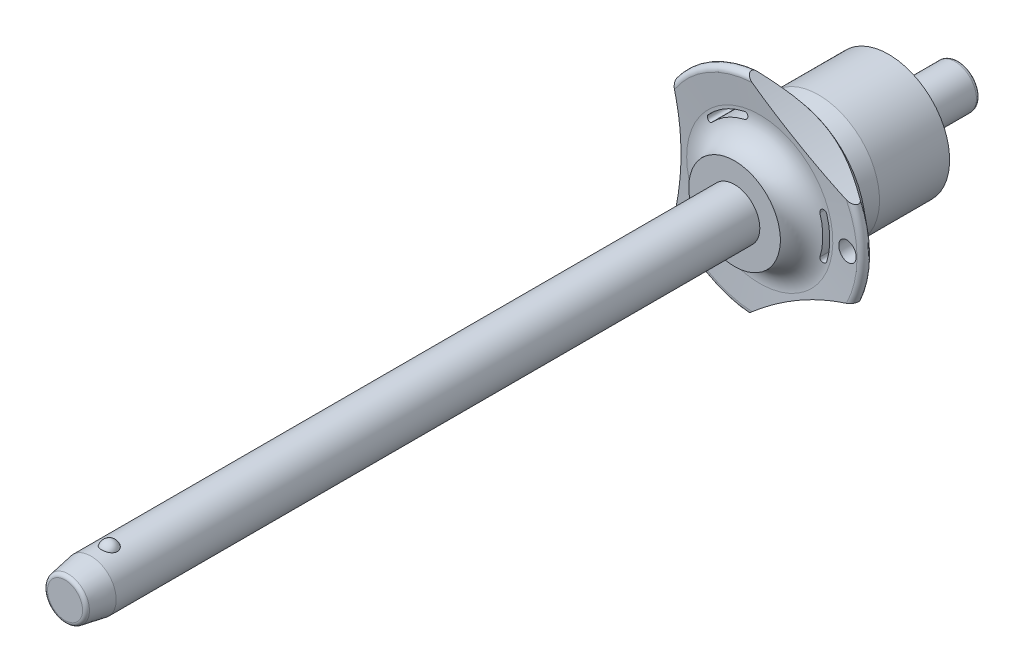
from build123d import *

# Parameters (mm, degrees)
SKETCH1_R           = 4
BOSS_EXTRUDE1_DEPTH = 100
SKETCH2_R           = 3.4
BOSS_EXTRUDE2_DEPTH = 33.3
BOSS_EXTRUDE3_START = 8.2
SKETCH1_2_R         = 4
BOSS_EXTRUDE3_DEPTH = 8.2
CHAMFER1_SIZE       = 4.1
CHAMFER1_SIZE2      = 0.722940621
FILLET1_R           = 0.6
SKETCH6_R           = 48.5
CUT_EXTRUDE1_DEPTH  = 136.351431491
CIRPATTERN1_COUNT   = 3
SKETCH7_R           = 1.5
CUT_EXTRUDE2_DEPTH  = 136.339657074


with BuildPart() as part:
    # Sketch1 → Boss-Extrude1 (new body)
    with BuildSketch(Plane.XY):
        Circle(SKETCH1_R)
    extrude(amount=-BOSS_EXTRUDE1_DEPTH)

    # Sketch2 → Boss-Extrude2 (add)
    with BuildSketch(Plane(origin=(0, 0, -100), x_dir=(-1, 0, 0), z_dir=(0, 0, -1))):
        Circle(SKETCH2_R)
    extrude(amount=BOSS_EXTRUDE2_DEPTH)

    # Sketch3 → Revolve1 (revolve)
    with BuildSketch(Plane(origin=(0, 0, 0), x_dir=(0, 0, -1), z_dir=(1, 0, 0))):
        with BuildLine():
            Line((-1.2, 4.8), (-1.2, 2.2))
            ThreePointArc((-1.2, 2.2), (0.1, 3.5), (-1.2, 4.8))
        make_face()
        with BuildLine():
            Line((-1.2, -2.2), (-1.2, -4.8))
            ThreePointArc((-1.2, -4.8), (0.1, -3.5), (-1.2, -2.2))
        make_face()
    revolve(axis=Axis((0, -2.2, 1.2), (0, 1, 0)))

    # Sketch1_2 → Boss-Extrude3 (add)
    with BuildSketch(Plane.XY.offset(BOSS_EXTRUDE3_START)):
        Circle(SKETCH1_2_R)
    extrude(amount=-BOSS_EXTRUDE3_DEPTH)

    # Chamfer1
    chamfer1_edges = [part.edges().sort_by_distance(p)[0] for p in [
        (-4, 0, 8.2),
    ]]
    chamfer1_side = [part.faces().sort_by_distance(p)[0] for p in [
        (-4, 0, -45.9),
    ]]
    chamfer(chamfer1_edges, length=CHAMFER1_SIZE, length2=CHAMFER1_SIZE2, reference=chamfer1_side[0])

    # Fillet1
    fillet1_edges = [part.edges().sort_by_distance(p)[0] for p in [
        (-3.277059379, 0, 8.2),
        (3.4, 0, -133.3),
    ]]
    fillet(fillet1_edges, radius=FILLET1_R)

    # Sketch4 → Revolve2 (revolve)
    with BuildSketch(Plane(origin=(0, 0, 0), x_dir=(0, 0, -1), z_dir=(1, 0, 0)), mode=Mode.PRIVATE) as revolve2_sk:
        Polygon((100, 0), (100, 5.554101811), (100.6, 5.554101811), (100.6, 7.220004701), (102.042714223, 8.052956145), (111.1, 9.65), (122.2, 9.65), (122.2, 0), align=None)
    revolve(revolve2_sk.sketch.rotate(Axis((0, 0, -122.2), (0, 0, 1)), 90), axis=Axis((0, 0, -122.2), (0, 0, 1)))

    # Sketch5 → Revolve3 (revolve)
    with BuildSketch(Plane(origin=(0, 0, 0), x_dir=(0, 0, -1), z_dir=(1, 0, 0)), mode=Mode.PRIVATE) as revolve3_sk:
        with BuildLine():
            Line((101.78715932, 11.570250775), (101.452568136, 15.735949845))
            ThreePointArc((101.452568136, 15.735949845), (101.946485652, 16.540188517), (102.862835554, 16.314230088))
            Line((102.862835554, 16.314230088), (106.326414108, 12.186497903))
            ThreePointArc((106.326414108, 12.186497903), (106.7, 11.109282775), (106.261488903, 10.056825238))
            ThreePointArc((106.261488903, 10.056825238), (103.289873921, 5.413681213), (102.25, 0))
            Line((102.25, 0), (97.8, 0))
            Line((97.8, 0), (97.8, 7.25))
            ThreePointArc((97.8, 7.25), (100.739473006, 8.537160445), (101.78715932, 11.570250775))
        make_face()
    revolve(revolve3_sk.sketch.rotate(Axis((0, 0, -102.25), (0, 0, 1)), 90), axis=Axis((0, 0, -102.25), (0, 0, 1)))

    # Sketch6 → Cut-Extrude1 (cut, through all)
    with BuildSketch(Plane.XY):
        with Locations((-60.9, 0)):
            Circle(SKETCH6_R)
        with BuildLine():
            ThreePointArc((10.58317358, -3.31492212), (11.090188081, 0), (10.58317358, 3.31492212))
            ThreePointArc((10.58317358, 3.31492212), (9.981564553, 3.62954405), (9.666942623, 3.027935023))
            ThreePointArc((9.666942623, 3.027935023), (10.130062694, 0), (9.666942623, -3.027935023))
            ThreePointArc((9.666942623, -3.027935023), (9.981564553, -3.62954405), (10.58317358, -3.31492212))
        make_face()
    cut_extrude1 = extrude(amount=-CUT_EXTRUDE1_DEPTH, mode=Mode.SUBTRACT)

    # CirPattern1: Cut-Extrude1 ×3 about axis
    cirpattern1_axis = Axis((0, 0, 0), (0, 0, 1))
    for i in range(1, CIRPATTERN1_COUNT):
        add(cut_extrude1.rotate(cirpattern1_axis, i * 360 / CIRPATTERN1_COUNT), mode=Mode.SUBTRACT)

    # Sketch7 → Cut-Extrude2 (cut, through all)
    with BuildSketch(Plane.XY):
        with Locations(Location((14.090188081, 0, 0), (0, 0, 225.108918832))):
            Circle(SKETCH7_R)
    extrude(amount=-CUT_EXTRUDE2_DEPTH, mode=Mode.SUBTRACT)


solid = part.part
